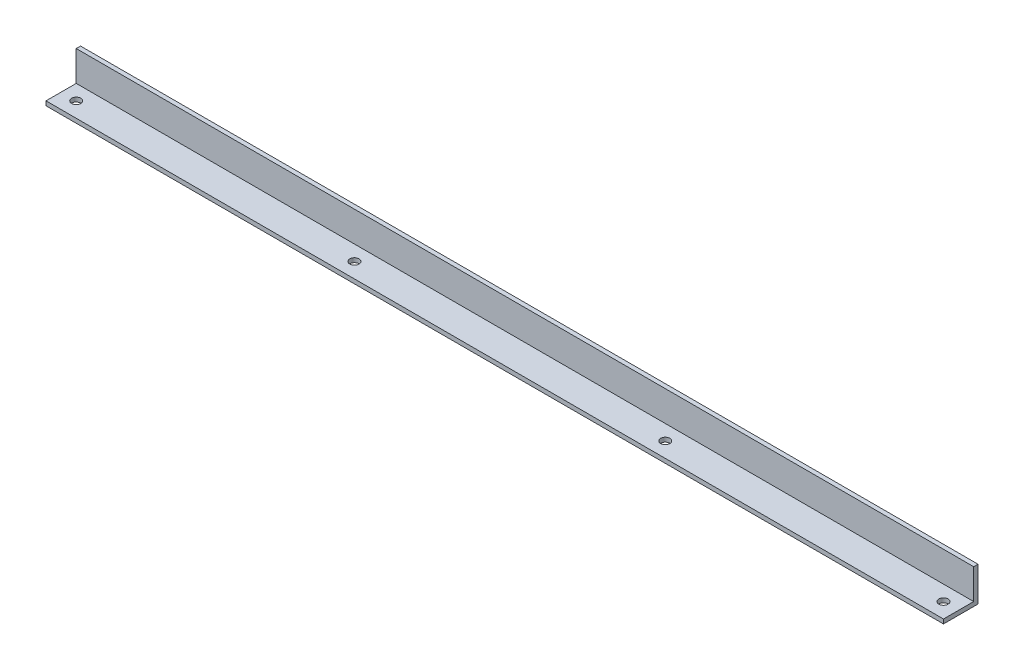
ISO-10303-21;
HEADER;
FILE_DESCRIPTION(('STEP AP214'),'2;1');
FILE_NAME('part.step','',(''),(''),'','','');
FILE_SCHEMA(('AUTOMOTIVE_DESIGN { 1 0 10303 214 1 1 1 1 }'));
ENDSEC;
DATA;
#1=APPLICATION_CONTEXT('core data for automotive mechanical design processes');
#2=APPLICATION_PROTOCOL_DEFINITION('international standard','automotive_design',2000,#1);
#3=PRODUCT_CONTEXT('',#1,'mechanical');
#4=PRODUCT('Part','Part','',(#3));
#5=PRODUCT_RELATED_PRODUCT_CATEGORY('part','',(#4));
#6=PRODUCT_DEFINITION_FORMATION('','',#4);
#7=PRODUCT_DEFINITION_CONTEXT('part definition',#1,'design');
#8=PRODUCT_DEFINITION('design','',#6,#7);
#9=PRODUCT_DEFINITION_SHAPE('','',#8);
#10=(LENGTH_UNIT() NAMED_UNIT(*) SI_UNIT(.MILLI.,.METRE.));
#11=(NAMED_UNIT(*) PLANE_ANGLE_UNIT() SI_UNIT($,.RADIAN.));
#12=(NAMED_UNIT(*) SI_UNIT($,.STERADIAN.) SOLID_ANGLE_UNIT());
#13=UNCERTAINTY_MEASURE_WITH_UNIT(LENGTH_MEASURE(1.E-05),#10,'distance_accuracy_value','');
#14=(GEOMETRIC_REPRESENTATION_CONTEXT(3) GLOBAL_UNCERTAINTY_ASSIGNED_CONTEXT((#13)) GLOBAL_UNIT_ASSIGNED_CONTEXT((#10,
#11,#12)) REPRESENTATION_CONTEXT('',''));
#15=CARTESIAN_POINT('',(0.,0.,0.));
#16=DIRECTION('',(0.,0.,1.));
#17=DIRECTION('',(1.,0.,0.));
#18=AXIS2_PLACEMENT_3D('',#15,#16,#17);
#19=CARTESIAN_POINT('',(330.2,3.175,-12.7));
#20=DIRECTION('',(-1.,0.,0.));
#21=DIRECTION('',(0.,0.,1.));
#22=AXIS2_PLACEMENT_3D('',#19,#20,#21);
#23=PLANE('',#22);
#24=DIRECTION('',(0.,0.,-1.));
#25=VECTOR('',#24,1.);
#26=CARTESIAN_POINT('',(330.2,0.,-12.7));
#27=LINE('',#26,#25);
#28=CARTESIAN_POINT('',(330.2,0.,12.7));
#29=VERTEX_POINT('',#28);
#30=CARTESIAN_POINT('',(330.2,0.,-12.7));
#31=VERTEX_POINT('',#30);
#32=EDGE_CURVE('E89',#29,#31,#27,.T.);
#33=ORIENTED_EDGE('',*,*,#32,.T.);
#34=DIRECTION('',(0.,-1.,0.));
#35=VECTOR('',#34,1.);
#36=CARTESIAN_POINT('',(330.2,3.175,-12.7));
#37=LINE('',#36,#35);
#38=CARTESIAN_POINT('',(330.2,25.4,-12.7));
#39=VERTEX_POINT('',#38);
#40=EDGE_CURVE('E11',#39,#31,#37,.T.);
#41=ORIENTED_EDGE('',*,*,#40,.F.);
#42=DIRECTION('',(0.,0.,-1.));
#43=VECTOR('',#42,1.);
#44=CARTESIAN_POINT('',(330.2,25.4,-9.525));
#45=LINE('',#44,#43);
#46=CARTESIAN_POINT('',(330.2,25.4,-9.525));
#47=VERTEX_POINT('',#46);
#48=EDGE_CURVE('E115',#47,#39,#45,.T.);
#49=ORIENTED_EDGE('',*,*,#48,.F.);
#50=DIRECTION('',(0.,-1.,0.));
#51=VECTOR('',#50,1.);
#52=CARTESIAN_POINT('',(330.2,25.4,-9.525));
#53=LINE('',#52,#51);
#54=CARTESIAN_POINT('',(330.2,3.175,-9.525));
#55=VERTEX_POINT('',#54);
#56=EDGE_CURVE('E98',#47,#55,#53,.T.);
#57=ORIENTED_EDGE('',*,*,#56,.T.);
#58=DIRECTION('',(0.,0.,-1.));
#59=VECTOR('',#58,1.);
#60=CARTESIAN_POINT('',(330.2,3.175,-12.7));
#61=LINE('',#60,#59);
#62=CARTESIAN_POINT('',(330.2,3.175,12.7));
#63=VERTEX_POINT('',#62);
#64=EDGE_CURVE('E83',#63,#55,#61,.T.);
#65=ORIENTED_EDGE('',*,*,#64,.F.);
#66=DIRECTION('',(0.,-1.,0.));
#67=VECTOR('',#66,1.);
#68=CARTESIAN_POINT('',(330.2,3.175,12.7));
#69=LINE('',#68,#67);
#70=EDGE_CURVE('E76',#63,#29,#69,.T.);
#71=ORIENTED_EDGE('',*,*,#70,.T.);
#72=EDGE_LOOP('',(#33,#41,#49,#57,#65,#71));
#73=FACE_BOUND('',#72,.T.);
#74=ADVANCED_FACE('F32',(#73),#23,.F.);
#75=CARTESIAN_POINT('',(-330.2,3.175,-12.7));
#76=DIRECTION('',(0.,0.,1.));
#77=DIRECTION('',(1.,0.,0.));
#78=AXIS2_PLACEMENT_3D('',#75,#76,#77);
#79=PLANE('',#78);
#80=DIRECTION('',(-1.,0.,0.));
#81=VECTOR('',#80,1.);
#82=CARTESIAN_POINT('',(-330.2,0.,-12.7));
#83=LINE('',#82,#81);
#84=CARTESIAN_POINT('',(-330.2,0.,-12.7));
#85=VERTEX_POINT('',#84);
#86=EDGE_CURVE('E93',#31,#85,#83,.T.);
#87=ORIENTED_EDGE('',*,*,#86,.T.);
#88=DIRECTION('',(0.,-1.,0.));
#89=VECTOR('',#88,1.);
#90=CARTESIAN_POINT('',(-330.2,3.175,-12.7));
#91=LINE('',#90,#89);
#92=CARTESIAN_POINT('',(-330.2,25.4,-12.7));
#93=VERTEX_POINT('',#92);
#94=EDGE_CURVE('E40',#93,#85,#91,.T.);
#95=ORIENTED_EDGE('',*,*,#94,.F.);
#96=DIRECTION('',(-1.,0.,0.));
#97=VECTOR('',#96,1.);
#98=CARTESIAN_POINT('',(330.2,25.4,-12.7));
#99=LINE('',#98,#97);
#100=EDGE_CURVE('E118',#39,#93,#99,.T.);
#101=ORIENTED_EDGE('',*,*,#100,.F.);
#102=ORIENTED_EDGE('',*,*,#40,.T.);
#103=EDGE_LOOP('',(#87,#95,#101,#102));
#104=FACE_BOUND('',#103,.T.);
#105=ADVANCED_FACE('F197',(#104),#79,.F.);
#106=CARTESIAN_POINT('',(-330.2,3.175,-12.7));
#107=DIRECTION('',(1.,0.,0.));
#108=DIRECTION('',(0.,0.,-1.));
#109=AXIS2_PLACEMENT_3D('',#106,#107,#108);
#110=PLANE('',#109);
#111=DIRECTION('',(0.,0.,1.));
#112=VECTOR('',#111,1.);
#113=CARTESIAN_POINT('',(-330.2,0.,-12.7));
#114=LINE('',#113,#112);
#115=CARTESIAN_POINT('',(-330.2,0.,12.7));
#116=VERTEX_POINT('',#115);
#117=EDGE_CURVE('E84',#85,#116,#114,.T.);
#118=ORIENTED_EDGE('',*,*,#117,.T.);
#119=DIRECTION('',(0.,-1.,0.));
#120=VECTOR('',#119,1.);
#121=CARTESIAN_POINT('',(-330.2,3.175,12.7));
#122=LINE('',#121,#120);
#123=CARTESIAN_POINT('',(-330.2,3.175,12.7));
#124=VERTEX_POINT('',#123);
#125=EDGE_CURVE('E79',#124,#116,#122,.T.);
#126=ORIENTED_EDGE('',*,*,#125,.F.);
#127=DIRECTION('',(0.,0.,1.));
#128=VECTOR('',#127,1.);
#129=CARTESIAN_POINT('',(-330.2,3.175,-12.7));
#130=LINE('',#129,#128);
#131=CARTESIAN_POINT('',(-330.2,3.175,-9.525));
#132=VERTEX_POINT('',#131);
#133=EDGE_CURVE('E108',#132,#124,#130,.T.);
#134=ORIENTED_EDGE('',*,*,#133,.F.);
#135=DIRECTION('',(0.,-1.,0.));
#136=VECTOR('',#135,1.);
#137=CARTESIAN_POINT('',(-330.2,25.4,-9.525));
#138=LINE('',#137,#136);
#139=CARTESIAN_POINT('',(-330.2,25.4,-9.525));
#140=VERTEX_POINT('',#139);
#141=EDGE_CURVE('E94',#140,#132,#138,.T.);
#142=ORIENTED_EDGE('',*,*,#141,.F.);
#143=DIRECTION('',(0.,0.,1.));
#144=VECTOR('',#143,1.);
#145=CARTESIAN_POINT('',(-330.2,25.4,-12.7));
#146=LINE('',#145,#144);
#147=EDGE_CURVE('E131',#93,#140,#146,.T.);
#148=ORIENTED_EDGE('',*,*,#147,.F.);
#149=ORIENTED_EDGE('',*,*,#94,.T.);
#150=EDGE_LOOP('',(#118,#126,#134,#142,#148,#149));
#151=FACE_BOUND('',#150,.T.);
#152=ADVANCED_FACE('F201',(#151),#110,.F.);
#153=CARTESIAN_POINT('',(-330.2,3.175,12.7));
#154=DIRECTION('',(0.,0.,-1.));
#155=DIRECTION('',(-1.,0.,0.));
#156=AXIS2_PLACEMENT_3D('',#153,#154,#155);
#157=PLANE('',#156);
#158=DIRECTION('',(1.,0.,0.));
#159=VECTOR('',#158,1.);
#160=CARTESIAN_POINT('',(-330.2,0.,12.7));
#161=LINE('',#160,#159);
#162=EDGE_CURVE('E73',#116,#29,#161,.T.);
#163=ORIENTED_EDGE('',*,*,#162,.T.);
#164=ORIENTED_EDGE('',*,*,#70,.F.);
#165=DIRECTION('',(1.,0.,0.));
#166=VECTOR('',#165,1.);
#167=CARTESIAN_POINT('',(-330.2,3.175,12.7));
#168=LINE('',#167,#166);
#169=EDGE_CURVE('E54',#124,#63,#168,.T.);
#170=ORIENTED_EDGE('',*,*,#169,.F.);
#171=ORIENTED_EDGE('',*,*,#125,.T.);
#172=EDGE_LOOP('',(#163,#164,#170,#171));
#173=FACE_BOUND('',#172,.T.);
#174=ADVANCED_FACE('F75',(#173),#157,.F.);
#175=CARTESIAN_POINT('',(330.2,3.175,12.7));
#176=DIRECTION('',(0.,1.,0.));
#177=DIRECTION('',(0.,0.,1.));
#178=AXIS2_PLACEMENT_3D('',#175,#176,#177);
#179=PLANE('',#178);
#180=CARTESIAN_POINT('',(114.3635,3.175,1.5875));
#181=DIRECTION('',(0.,1.,0.));
#182=DIRECTION('',(0.,0.,1.));
#183=AXIS2_PLACEMENT_3D('',#180,#181,#182);
#184=CIRCLE('',#183,3.37819999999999);
#185=CARTESIAN_POINT('',(114.3635,3.175,4.96569999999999));
#186=VERTEX_POINT('',#185);
#187=EDGE_CURVE('E156',#186,#186,#184,.T.);
#188=ORIENTED_EDGE('',*,*,#187,.F.);
#189=EDGE_LOOP('',(#188));
#190=FACE_BOUND('',#189,.T.);
#191=CARTESIAN_POINT('',(319.0875,3.175,1.5875));
#192=DIRECTION('',(0.,1.,0.));
#193=DIRECTION('',(0.,0.,1.));
#194=AXIS2_PLACEMENT_3D('',#191,#192,#193);
#195=CIRCLE('',#194,3.37819999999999);
#196=CARTESIAN_POINT('',(319.0875,3.175,4.96569999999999));
#197=VERTEX_POINT('',#196);
#198=EDGE_CURVE('E150',#197,#197,#195,.T.);
#199=ORIENTED_EDGE('',*,*,#198,.F.);
#200=EDGE_LOOP('',(#199));
#201=FACE_BOUND('',#200,.T.);
#202=CARTESIAN_POINT('',(-114.3635,3.175,1.5875));
#203=DIRECTION('',(0.,1.,0.));
#204=DIRECTION('',(0.,0.,1.));
#205=AXIS2_PLACEMENT_3D('',#202,#203,#204);
#206=CIRCLE('',#205,3.37819999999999);
#207=CARTESIAN_POINT('',(-114.3635,3.175,4.96569999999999));
#208=VERTEX_POINT('',#207);
#209=EDGE_CURVE('E144',#208,#208,#206,.T.);
#210=ORIENTED_EDGE('',*,*,#209,.F.);
#211=EDGE_LOOP('',(#210));
#212=FACE_BOUND('',#211,.T.);
#213=CARTESIAN_POINT('',(-319.0875,3.175,1.5875));
#214=DIRECTION('',(0.,1.,0.));
#215=DIRECTION('',(0.,0.,1.));
#216=AXIS2_PLACEMENT_3D('',#213,#214,#215);
#217=CIRCLE('',#216,3.37819999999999);
#218=CARTESIAN_POINT('',(-319.0875,3.175,4.96569999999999));
#219=VERTEX_POINT('',#218);
#220=EDGE_CURVE('E138',#219,#219,#217,.T.);
#221=ORIENTED_EDGE('',*,*,#220,.F.);
#222=EDGE_LOOP('',(#221));
#223=FACE_BOUND('',#222,.T.);
#224=DIRECTION('',(1.,0.,0.));
#225=VECTOR('',#224,1.);
#226=CARTESIAN_POINT('',(-330.2,3.175,-9.525));
#227=LINE('',#226,#225);
#228=EDGE_CURVE('E48',#132,#55,#227,.T.);
#229=ORIENTED_EDGE('',*,*,#228,.F.);
#230=ORIENTED_EDGE('',*,*,#133,.T.);
#231=ORIENTED_EDGE('',*,*,#169,.T.);
#232=ORIENTED_EDGE('',*,*,#64,.T.);
#233=EDGE_LOOP('',(#229,#230,#231,#232));
#234=FACE_BOUND('',#233,.T.);
#235=ADVANCED_FACE('F171',(#190,#201,#212,#223,#234),#179,.T.);
#236=CARTESIAN_POINT('',(330.2,0.,12.7));
#237=DIRECTION('',(0.,1.,0.));
#238=DIRECTION('',(0.,0.,1.));
#239=AXIS2_PLACEMENT_3D('',#236,#237,#238);
#240=PLANE('',#239);
#241=CARTESIAN_POINT('',(114.3635,0.,1.5875));
#242=DIRECTION('',(0.,1.,0.));
#243=DIRECTION('',(0.,0.,1.));
#244=AXIS2_PLACEMENT_3D('',#241,#242,#243);
#245=CIRCLE('',#244,3.37819999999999);
#246=CARTESIAN_POINT('',(114.3635,0.,4.96569999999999));
#247=VERTEX_POINT('',#246);
#248=EDGE_CURVE('E153',#247,#247,#245,.T.);
#249=ORIENTED_EDGE('',*,*,#248,.T.);
#250=EDGE_LOOP('',(#249));
#251=FACE_BOUND('',#250,.T.);
#252=CARTESIAN_POINT('',(319.0875,0.,1.5875));
#253=DIRECTION('',(0.,1.,0.));
#254=DIRECTION('',(0.,0.,1.));
#255=AXIS2_PLACEMENT_3D('',#252,#253,#254);
#256=CIRCLE('',#255,3.37819999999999);
#257=CARTESIAN_POINT('',(319.0875,0.,4.96569999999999));
#258=VERTEX_POINT('',#257);
#259=EDGE_CURVE('E147',#258,#258,#256,.T.);
#260=ORIENTED_EDGE('',*,*,#259,.T.);
#261=EDGE_LOOP('',(#260));
#262=FACE_BOUND('',#261,.T.);
#263=CARTESIAN_POINT('',(-114.3635,0.,1.5875));
#264=DIRECTION('',(0.,1.,0.));
#265=DIRECTION('',(0.,0.,1.));
#266=AXIS2_PLACEMENT_3D('',#263,#264,#265);
#267=CIRCLE('',#266,3.37819999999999);
#268=CARTESIAN_POINT('',(-114.3635,0.,4.96569999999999));
#269=VERTEX_POINT('',#268);
#270=EDGE_CURVE('E141',#269,#269,#267,.T.);
#271=ORIENTED_EDGE('',*,*,#270,.T.);
#272=EDGE_LOOP('',(#271));
#273=FACE_BOUND('',#272,.T.);
#274=CARTESIAN_POINT('',(-319.0875,0.,1.5875));
#275=DIRECTION('',(0.,1.,0.));
#276=DIRECTION('',(0.,0.,1.));
#277=AXIS2_PLACEMENT_3D('',#274,#275,#276);
#278=CIRCLE('',#277,3.37819999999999);
#279=CARTESIAN_POINT('',(-319.0875,0.,4.96569999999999));
#280=VERTEX_POINT('',#279);
#281=EDGE_CURVE('E119',#280,#280,#278,.T.);
#282=ORIENTED_EDGE('',*,*,#281,.T.);
#283=EDGE_LOOP('',(#282));
#284=FACE_BOUND('',#283,.T.);
#285=ORIENTED_EDGE('',*,*,#32,.F.);
#286=ORIENTED_EDGE('',*,*,#162,.F.);
#287=ORIENTED_EDGE('',*,*,#117,.F.);
#288=ORIENTED_EDGE('',*,*,#86,.F.);
#289=EDGE_LOOP('',(#285,#286,#287,#288));
#290=FACE_BOUND('',#289,.T.);
#291=ADVANCED_FACE('F92',(#251,#262,#273,#284,#290),#240,.F.);
#292=CARTESIAN_POINT('',(-330.2,25.4,-9.525));
#293=DIRECTION('',(0.,0.,-1.));
#294=DIRECTION('',(-1.,0.,0.));
#295=AXIS2_PLACEMENT_3D('',#292,#293,#294);
#296=PLANE('',#295);
#297=ORIENTED_EDGE('',*,*,#228,.T.);
#298=ORIENTED_EDGE('',*,*,#56,.F.);
#299=DIRECTION('',(1.,0.,0.));
#300=VECTOR('',#299,1.);
#301=CARTESIAN_POINT('',(-330.2,25.4,-9.525));
#302=LINE('',#301,#300);
#303=EDGE_CURVE('E126',#140,#47,#302,.T.);
#304=ORIENTED_EDGE('',*,*,#303,.F.);
#305=ORIENTED_EDGE('',*,*,#141,.T.);
#306=EDGE_LOOP('',(#297,#298,#304,#305));
#307=FACE_BOUND('',#306,.T.);
#308=ADVANCED_FACE('F193',(#307),#296,.F.);
#309=CARTESIAN_POINT('',(-330.2,25.4,-12.7));
#310=DIRECTION('',(0.,1.,0.));
#311=DIRECTION('',(0.,0.,1.));
#312=AXIS2_PLACEMENT_3D('',#309,#310,#311);
#313=PLANE('',#312);
#314=ORIENTED_EDGE('',*,*,#100,.T.);
#315=ORIENTED_EDGE('',*,*,#147,.T.);
#316=ORIENTED_EDGE('',*,*,#303,.T.);
#317=ORIENTED_EDGE('',*,*,#48,.T.);
#318=EDGE_LOOP('',(#314,#315,#316,#317));
#319=FACE_BOUND('',#318,.T.);
#320=ADVANCED_FACE('F184',(#319),#313,.T.);
#321=CARTESIAN_POINT('',(-319.0875,0.,1.5875));
#322=DIRECTION('',(0.,1.,0.));
#323=DIRECTION('',(0.,0.,1.));
#324=AXIS2_PLACEMENT_3D('',#321,#322,#323);
#325=CYLINDRICAL_SURFACE('',#324,3.37819999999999);
#326=ORIENTED_EDGE('',*,*,#281,.F.);
#327=EDGE_LOOP('',(#326));
#328=FACE_BOUND('',#327,.T.);
#329=ORIENTED_EDGE('',*,*,#220,.T.);
#330=EDGE_LOOP('',(#329));
#331=FACE_BOUND('',#330,.T.);
#332=ADVANCED_FACE('F181',(#328,#331),#325,.F.);
#333=CARTESIAN_POINT('',(-114.3635,0.,1.5875));
#334=DIRECTION('',(0.,1.,0.));
#335=DIRECTION('',(0.,0.,1.));
#336=AXIS2_PLACEMENT_3D('',#333,#334,#335);
#337=CYLINDRICAL_SURFACE('',#336,3.37819999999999);
#338=ORIENTED_EDGE('',*,*,#270,.F.);
#339=EDGE_LOOP('',(#338));
#340=FACE_BOUND('',#339,.T.);
#341=ORIENTED_EDGE('',*,*,#209,.T.);
#342=EDGE_LOOP('',(#341));
#343=FACE_BOUND('',#342,.T.);
#344=ADVANCED_FACE('F183',(#340,#343),#337,.F.);
#345=CARTESIAN_POINT('',(319.0875,0.,1.5875));
#346=DIRECTION('',(0.,1.,0.));
#347=DIRECTION('',(0.,0.,1.));
#348=AXIS2_PLACEMENT_3D('',#345,#346,#347);
#349=CYLINDRICAL_SURFACE('',#348,3.37819999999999);
#350=ORIENTED_EDGE('',*,*,#259,.F.);
#351=EDGE_LOOP('',(#350));
#352=FACE_BOUND('',#351,.T.);
#353=ORIENTED_EDGE('',*,*,#198,.T.);
#354=EDGE_LOOP('',(#353));
#355=FACE_BOUND('',#354,.T.);
#356=ADVANCED_FACE('F167',(#352,#355),#349,.F.);
#357=CARTESIAN_POINT('',(114.3635,0.,1.5875));
#358=DIRECTION('',(0.,1.,0.));
#359=DIRECTION('',(0.,0.,1.));
#360=AXIS2_PLACEMENT_3D('',#357,#358,#359);
#361=CYLINDRICAL_SURFACE('',#360,3.37819999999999);
#362=ORIENTED_EDGE('',*,*,#248,.F.);
#363=EDGE_LOOP('',(#362));
#364=FACE_BOUND('',#363,.T.);
#365=ORIENTED_EDGE('',*,*,#187,.T.);
#366=EDGE_LOOP('',(#365));
#367=FACE_BOUND('',#366,.T.);
#368=ADVANCED_FACE('F164',(#364,#367),#361,.F.);
#369=CLOSED_SHELL('',(#74,#105,#152,#174,#235,#291,#308,#320,#332,#344,#356,#368));
#370=MANIFOLD_SOLID_BREP('B2',#369);
#371=ADVANCED_BREP_SHAPE_REPRESENTATION('',(#18,#370),#14);
#372=SHAPE_DEFINITION_REPRESENTATION(#9,#371);
ENDSEC;
END-ISO-10303-21;
